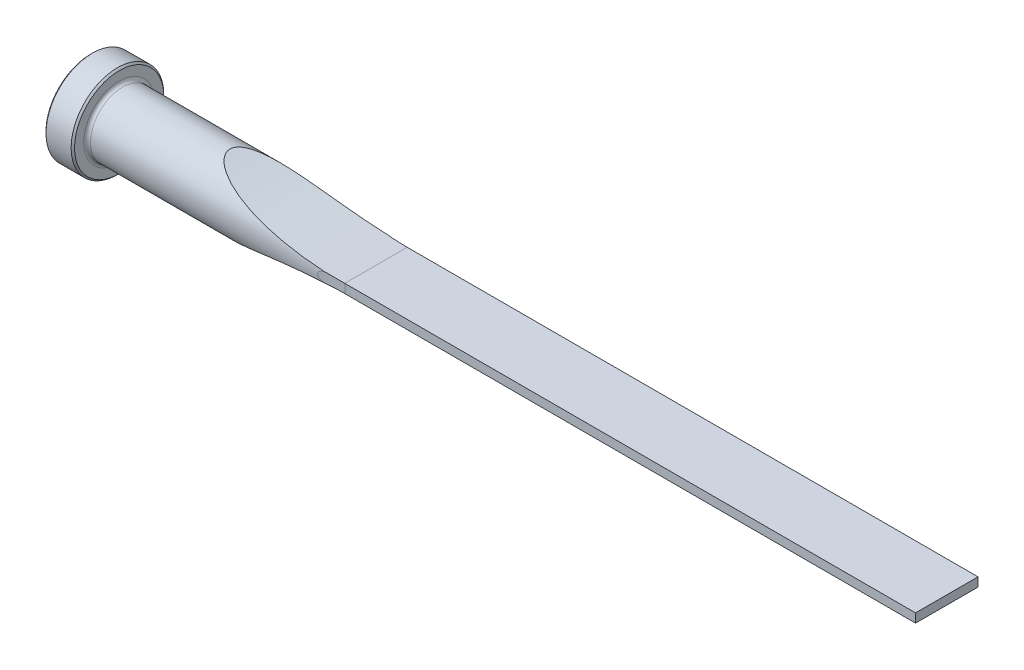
ISO-10303-21;
HEADER;
FILE_DESCRIPTION(('STEP AP214'),'2;1');
FILE_NAME('part.step','',(''),(''),'','','');
FILE_SCHEMA(('AUTOMOTIVE_DESIGN { 1 0 10303 214 1 1 1 1 }'));
ENDSEC;
DATA;
#1=APPLICATION_CONTEXT('core data for automotive mechanical design processes');
#2=APPLICATION_PROTOCOL_DEFINITION('international standard','automotive_design',2000,#1);
#3=PRODUCT_CONTEXT('',#1,'mechanical');
#4=PRODUCT('Part','Part','',(#3));
#5=PRODUCT_RELATED_PRODUCT_CATEGORY('part','',(#4));
#6=PRODUCT_DEFINITION_FORMATION('','',#4);
#7=PRODUCT_DEFINITION_CONTEXT('part definition',#1,'design');
#8=PRODUCT_DEFINITION('design','',#6,#7);
#9=PRODUCT_DEFINITION_SHAPE('','',#8);
#10=(LENGTH_UNIT() NAMED_UNIT(*) SI_UNIT(.MILLI.,.METRE.));
#11=(NAMED_UNIT(*) PLANE_ANGLE_UNIT() SI_UNIT($,.RADIAN.));
#12=(NAMED_UNIT(*) SI_UNIT($,.STERADIAN.) SOLID_ANGLE_UNIT());
#13=UNCERTAINTY_MEASURE_WITH_UNIT(LENGTH_MEASURE(1.E-05),#10,'distance_accuracy_value','');
#14=(GEOMETRIC_REPRESENTATION_CONTEXT(3) GLOBAL_UNCERTAINTY_ASSIGNED_CONTEXT((#13)) GLOBAL_UNIT_ASSIGNED_CONTEXT((#10,
#11,#12)) REPRESENTATION_CONTEXT('',''));
#15=CARTESIAN_POINT('',(0.,0.,0.));
#16=DIRECTION('',(0.,0.,1.));
#17=DIRECTION('',(1.,0.,0.));
#18=AXIS2_PLACEMENT_3D('',#15,#16,#17);
#19=CARTESIAN_POINT('',(0.,0.,0.));
#20=DIRECTION('',(-1.,0.,0.));
#21=DIRECTION('',(0.,0.,1.));
#22=AXIS2_PLACEMENT_3D('',#19,#20,#21);
#23=CYLINDRICAL_SURFACE('',#22,7.14375);
#24=CARTESIAN_POINT('',(7.112,0.,0.));
#25=DIRECTION('',(-1.,0.,0.));
#26=DIRECTION('',(0.,0.,1.));
#27=AXIS2_PLACEMENT_3D('',#24,#25,#26);
#28=CIRCLE('',#27,7.14375);
#29=CARTESIAN_POINT('',(7.112,0.,7.14375));
#30=VERTEX_POINT('',#29);
#31=EDGE_CURVE('E153',#30,#30,#28,.F.);
#32=ORIENTED_EDGE('',*,*,#31,.T.);
#33=EDGE_LOOP('',(#32));
#34=FACE_BOUND('',#33,.T.);
#35=CARTESIAN_POINT('',(63.5,1.66545622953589,6.94690000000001));
#36=CARTESIAN_POINT('',(63.2602205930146,1.66539130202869,6.9468983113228));
#37=CARTESIAN_POINT('',(63.0204291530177,1.66140650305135,6.94787008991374));
#38=CARTESIAN_POINT('',(62.5409765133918,1.64513557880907,6.95174989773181));
#39=CARTESIAN_POINT('',(62.3013155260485,1.63284358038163,6.95465929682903));
#40=CARTESIAN_POINT('',(61.8211110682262,1.59939046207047,6.96242801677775));
#41=CARTESIAN_POINT('',(61.5805715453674,1.57817397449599,6.96729950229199));
#42=CARTESIAN_POINT('',(61.100708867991,1.52578189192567,6.97895857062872));
#43=CARTESIAN_POINT('',(60.8613853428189,1.49460954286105,6.98574552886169));
#44=CARTESIAN_POINT('',(60.3341219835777,1.41275931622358,7.00282004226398));
#45=CARTESIAN_POINT('',(60.046591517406,1.35935208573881,7.01354421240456));
#46=CARTESIAN_POINT('',(59.6193276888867,1.26169102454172,7.03152533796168));
#47=CARTESIAN_POINT('',(59.4775502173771,1.22620337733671,7.03783632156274));
#48=CARTESIAN_POINT('',(59.1960773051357,1.14791266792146,7.05103266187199));
#49=CARTESIAN_POINT('',(59.0563810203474,1.10511266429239,7.05791777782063));
#50=CARTESIAN_POINT('',(58.7797072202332,1.00972668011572,7.07219584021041));
#51=CARTESIAN_POINT('',(58.6427427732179,0.957102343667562,7.07959070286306));
#52=CARTESIAN_POINT('',(58.3751712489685,0.838413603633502,7.09463865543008));
#53=CARTESIAN_POINT('',(58.2445402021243,0.772405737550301,7.10229054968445));
#54=CARTESIAN_POINT('',(58.0346934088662,0.642339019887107,7.11501322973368));
#55=CARTESIAN_POINT('',(57.952121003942,0.584056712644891,7.12014673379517));
#56=CARTESIAN_POINT('',(57.8379827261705,0.48446373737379,7.12738091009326));
#57=CARTESIAN_POINT('',(57.801394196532,0.449023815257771,7.12972544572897));
#58=CARTESIAN_POINT('',(57.7337306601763,0.373169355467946,7.13409783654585));
#59=CARTESIAN_POINT('',(57.7026400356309,0.332769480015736,7.13612658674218));
#60=CARTESIAN_POINT('',(57.6599545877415,0.263678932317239,7.13892891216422));
#61=CARTESIAN_POINT('',(57.6455334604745,0.236759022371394,7.13988012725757));
#62=CARTESIAN_POINT('',(57.6208913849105,0.181039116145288,7.14150989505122));
#63=CARTESIAN_POINT('',(57.610665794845,0.152241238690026,7.142188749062));
#64=CARTESIAN_POINT('',(57.5953440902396,0.0929451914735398,7.14320728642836));
#65=CARTESIAN_POINT('',(57.5903022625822,0.0624324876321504,7.14354337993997));
#66=CARTESIAN_POINT('',(57.5862149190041,0.00100805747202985,7.1438157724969));
#67=CARTESIAN_POINT('',(57.5871656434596,-0.0299034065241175,7.14375232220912));
#68=CARTESIAN_POINT('',(57.5944670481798,-0.0874662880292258,7.14326597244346));
#69=CARTESIAN_POINT('',(57.6001902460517,-0.114201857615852,7.14288484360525));
#70=CARTESIAN_POINT('',(57.6156498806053,-0.166474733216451,7.14185795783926));
#71=CARTESIAN_POINT('',(57.6253896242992,-0.192011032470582,7.14121198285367));
#72=CARTESIAN_POINT('',(57.6541940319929,-0.254728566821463,7.13930814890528));
#73=CARTESIAN_POINT('',(57.6754634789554,-0.29088512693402,7.13790755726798));
#74=CARTESIAN_POINT('',(57.7232657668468,-0.359496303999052,7.13478175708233));
#75=CARTESIAN_POINT('',(57.7498129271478,-0.39194046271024,7.13305566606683));
#76=CARTESIAN_POINT('',(57.8310525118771,-0.480375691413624,7.12781634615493));
#77=CARTESIAN_POINT('',(57.8901250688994,-0.53227243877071,7.12405564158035));
#78=CARTESIAN_POINT('',(58.0145571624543,-0.627749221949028,7.11627461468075));
#79=CARTESIAN_POINT('',(58.0799370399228,-0.671300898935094,7.11225346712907));
#80=CARTESIAN_POINT('',(58.2535094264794,-0.775899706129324,7.10178396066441));
#81=CARTESIAN_POINT('',(58.3644424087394,-0.83234654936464,7.09528710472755));
#82=CARTESIAN_POINT('',(58.590985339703,-0.935122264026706,7.08246694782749));
#83=CARTESIAN_POINT('',(58.7066056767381,-0.981427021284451,7.07614409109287));
#84=CARTESIAN_POINT('',(58.9416713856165,-1.06691744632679,7.06376189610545));
#85=CARTESIAN_POINT('',(59.0611424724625,-1.10603221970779,7.05770558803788));
#86=CARTESIAN_POINT('',(59.3017233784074,-1.17826382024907,7.04600484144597));
#87=CARTESIAN_POINT('',(59.4228312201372,-1.21138729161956,7.04035995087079));
#88=CARTESIAN_POINT('',(59.7104613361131,-1.28394915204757,7.02754987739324));
#89=CARTESIAN_POINT('',(59.8775128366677,-1.32131606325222,7.02057652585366));
#90=CARTESIAN_POINT('',(60.2131128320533,-1.38885630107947,7.00752462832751));
#91=CARTESIAN_POINT('',(60.3816617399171,-1.41902757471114,7.00144633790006));
#92=CARTESIAN_POINT('',(60.8894036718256,-1.50059649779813,6.98459356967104));
#93=CARTESIAN_POINT('',(61.2301123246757,-1.54291316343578,6.97522715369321));
#94=CARTESIAN_POINT('',(61.8927532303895,-1.60644233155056,6.96084942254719));
#95=CARTESIAN_POINT('',(62.2145799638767,-1.62877275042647,6.95560971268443));
#96=CARTESIAN_POINT('',(62.6971835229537,-1.65088759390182,6.9503801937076));
#97=CARTESIAN_POINT('',(62.8577023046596,-1.65636275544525,6.94907536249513));
#98=CARTESIAN_POINT('',(63.1788130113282,-1.66364180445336,6.94733518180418));
#99=CARTESIAN_POINT('',(63.3394049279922,-1.66544603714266,6.94689975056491));
#100=CARTESIAN_POINT('',(63.5,-1.66545622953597,6.9469));
#101=B_SPLINE_CURVE_WITH_KNOTS('',3,(#35,#36,#37,#38,#39,#40,#41,#42,#43,#44,#45,#46,#47,#48,
#49,#50,#51,#52,#53,#54,#55,#56,#57,#58,#59,#60,#61,#62,#63,#64,#65,#66,#67,#68,#69,#70,#71,#72,
#73,#74,#75,#76,#77,#78,#79,#80,#81,#82,#83,#84,#85,#86,#87,#88,#89,#90,#91,#92,#93,#94,#95,#96,
#97,#98,#99,#100),.UNSPECIFIED.,.F.,.F.,(4,2,2,2,2,2,2,2,2,2,2,2,2,2,2,2,2,2,2,2,2,2,2,2,2,2,2,
2,2,2,2,2,4),(0.,0.719321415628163,1.43915192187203,2.1635157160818,2.88764358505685,
3.76473487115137,4.20345743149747,4.64199693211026,5.08228579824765,5.52075206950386,
5.82287393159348,5.97551162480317,6.12770850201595,6.21909711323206,6.31038434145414,
6.40261812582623,6.49479405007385,6.57646960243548,6.65821253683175,6.78340264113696,
6.90893716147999,7.14377497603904,7.37939720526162,7.75236878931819,8.12621776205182,
8.50357546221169,8.88051208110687,9.39425854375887,9.90815140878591,10.9377202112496,
11.905257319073,12.3870700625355,12.8688374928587),.UNSPECIFIED.);
#102=CARTESIAN_POINT('',(59.0519236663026,1.10194860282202,7.05824860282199));
#103=VERTEX_POINT('',#102);
#104=CARTESIAN_POINT('',(59.0519236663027,-1.101948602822,7.058248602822));
#105=VERTEX_POINT('',#104);
#106=EDGE_CURVE('E156',#103,#105,#101,.T.);
#107=ORIENTED_EDGE('',*,*,#106,.F.);
#108=CARTESIAN_POINT('',(63.5,0.990599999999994,7.07473502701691));
#109=CARTESIAN_POINT('',(62.9103241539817,0.990599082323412,7.07470296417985));
#110=CARTESIAN_POINT('',(62.3206477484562,0.996466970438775,7.07391235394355));
#111=CARTESIAN_POINT('',(61.1415303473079,1.01993388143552,7.07058423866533));
#112=CARTESIAN_POINT('',(60.5520893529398,1.03753296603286,7.06804672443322));
#113=CARTESIAN_POINT('',(59.3732377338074,1.08447362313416,7.06099231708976));
#114=CARTESIAN_POINT('',(58.7838274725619,1.11382410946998,7.05647392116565));
#115=CARTESIAN_POINT('',(57.6057314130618,1.18425404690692,7.04499738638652));
#116=CARTESIAN_POINT('',(57.0170456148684,1.22533349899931,7.03803924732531));
#117=CARTESIAN_POINT('',(55.8244251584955,1.32049668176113,7.02081585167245));
#118=CARTESIAN_POINT('',(55.2205178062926,1.37490787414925,7.01046466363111));
#119=CARTESIAN_POINT('',(54.0140276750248,1.49606453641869,6.9856124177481));
#120=CARTESIAN_POINT('',(53.4114448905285,1.56280995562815,6.97111137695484));
#121=CARTESIAN_POINT('',(52.2082743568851,1.70855010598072,6.93683094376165));
#122=CARTESIAN_POINT('',(51.6076856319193,1.78753750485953,6.91705470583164));
#123=CARTESIAN_POINT('',(50.4084984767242,1.95773166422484,6.87082457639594));
#124=CARTESIAN_POINT('',(49.8099000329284,2.04893834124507,6.84437073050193));
#125=CARTESIAN_POINT('',(48.6143658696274,2.24360840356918,6.78305377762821));
#126=CARTESIAN_POINT('',(48.0174330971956,2.34708671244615,6.74818037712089));
#127=CARTESIAN_POINT('',(46.8264543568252,2.56609326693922,6.66797848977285));
#128=CARTESIAN_POINT('',(46.2324084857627,2.68162191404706,6.6226496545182));
#129=CARTESIAN_POINT('',(45.0466634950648,2.92479431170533,6.5189162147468));
#130=CARTESIAN_POINT('',(44.4549715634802,3.05246212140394,6.46048531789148));
#131=CARTESIAN_POINT('',(43.2760816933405,3.3194249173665,6.32746650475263));
#132=CARTESIAN_POINT('',(42.6888833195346,3.45871876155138,6.25288017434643));
#133=CARTESIAN_POINT('',(41.5264508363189,3.7469545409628,6.08449921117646));
#134=CARTESIAN_POINT('',(40.9511560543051,3.89577518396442,5.99092211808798));
#135=CARTESIAN_POINT('',(40.0936030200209,4.12674767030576,5.83196356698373));
#136=CARTESIAN_POINT('',(39.8085742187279,4.20505086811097,5.7758609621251));
#137=CARTESIAN_POINT('',(39.2406776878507,4.36410003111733,5.65665009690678));
#138=CARTESIAN_POINT('',(38.9578098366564,4.44484585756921,5.59354223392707));
#139=CARTESIAN_POINT('',(38.3956379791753,4.60832522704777,5.45963602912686));
#140=CARTESIAN_POINT('',(38.1163247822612,4.69105052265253,5.38886633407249));
#141=CARTESIAN_POINT('',(37.5607622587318,4.85854663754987,5.23835580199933));
#142=CARTESIAN_POINT('',(37.2845126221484,4.94331724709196,5.15861588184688));
#143=CARTESIAN_POINT('',(36.7359696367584,5.11454699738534,4.98889726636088));
#144=CARTESIAN_POINT('',(36.4636731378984,5.20100464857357,4.89892729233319));
#145=CARTESIAN_POINT('',(35.9237786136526,5.37526169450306,4.70707325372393));
#146=CARTESIAN_POINT('',(35.6561794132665,5.46306074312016,4.60519221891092));
#147=CARTESIAN_POINT('',(35.2665465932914,5.59291612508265,4.44486458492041));
#148=CARTESIAN_POINT('',(35.1421709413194,5.63467705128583,4.39184723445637));
#149=CARTESIAN_POINT('',(34.8949544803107,5.71828624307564,4.28241819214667));
#150=CARTESIAN_POINT('',(34.7721136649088,5.76013450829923,4.22600651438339));
#151=CARTESIAN_POINT('',(34.4060515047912,5.88572718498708,4.05117747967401));
#152=CARTESIAN_POINT('',(34.1654246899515,5.96947469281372,3.92722057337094));
#153=CARTESIAN_POINT('',(33.6949271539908,6.13542400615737,3.6625148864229));
#154=CARTESIAN_POINT('',(33.4650029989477,6.21763189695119,3.52186571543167));
#155=CARTESIAN_POINT('',(33.0183679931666,6.3793056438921,3.21978250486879));
#156=CARTESIAN_POINT('',(32.8016409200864,6.45877481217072,3.05837477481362));
#157=CARTESIAN_POINT('',(32.4371987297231,6.59389778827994,2.75217825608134));
#158=CARTESIAN_POINT('',(32.2854343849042,6.65067752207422,2.61275026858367));
#159=CARTESIAN_POINT('',(31.9968284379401,6.7594749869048,2.31680001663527));
#160=CARTESIAN_POINT('',(31.8600109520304,6.8114850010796,2.16025091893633));
#161=CARTESIAN_POINT('',(31.6062737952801,6.90856051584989,1.82635315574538));
#162=CARTESIAN_POINT('',(31.4896089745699,6.95353647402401,1.6487801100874));
#163=CARTESIAN_POINT('',(31.2876750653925,7.0317565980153,1.27427241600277));
#164=CARTESIAN_POINT('',(31.2023055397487,7.06503828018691,1.07740232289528));
#165=CARTESIAN_POINT('',(31.0925894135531,7.10791984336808,0.729148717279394));
#166=CARTESIAN_POINT('',(31.0576492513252,7.12161751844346,0.581622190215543));
#167=CARTESIAN_POINT('',(31.0114591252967,7.13973680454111,0.282339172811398));
#168=CARTESIAN_POINT('',(31.0001909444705,7.14416554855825,0.130586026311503));
#169=CARTESIAN_POINT('',(31.002466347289,7.14327190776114,-0.172861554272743));
#170=CARTESIAN_POINT('',(31.0160366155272,7.13793903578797,-0.324555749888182));
#171=CARTESIAN_POINT('',(31.0666681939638,7.11808225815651,-0.623343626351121));
#172=CARTESIAN_POINT('',(31.1037477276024,7.1035512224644,-0.770433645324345));
#173=CARTESIAN_POINT('',(31.2114848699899,7.06146282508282,-1.09682669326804));
#174=CARTESIAN_POINT('',(31.2886312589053,7.03139963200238,-1.27364110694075));
#175=CARTESIAN_POINT('',(31.4684561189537,6.96171823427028,-1.61172011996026));
#176=CARTESIAN_POINT('',(31.5711889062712,6.92207970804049,-1.77295061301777));
#177=CARTESIAN_POINT('',(31.7728575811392,6.84478315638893,-2.04898139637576));
#178=CARTESIAN_POINT('',(31.8684500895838,6.80831213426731,-2.16662167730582));
#179=CARTESIAN_POINT('',(32.0690181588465,6.73222770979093,-2.39259283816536));
#180=CARTESIAN_POINT('',(32.173999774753,6.69261228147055,-2.50091762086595));
#181=CARTESIAN_POINT('',(32.3914295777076,6.61106855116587,-2.70914308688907));
#182=CARTESIAN_POINT('',(32.5038889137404,6.56913681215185,-2.80903066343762));
#183=CARTESIAN_POINT('',(32.7346711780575,6.48364767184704,-3.00108753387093));
#184=CARTESIAN_POINT('',(32.8529964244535,6.44008962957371,-3.09325373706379));
#185=CARTESIAN_POINT('',(33.0956983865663,6.35135578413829,-3.27161717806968));
#186=CARTESIAN_POINT('',(33.2201283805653,6.30616726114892,-3.35773518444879));
#187=CARTESIAN_POINT('',(33.472919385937,6.21502104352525,-3.52358007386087));
#188=CARTESIAN_POINT('',(33.6012812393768,6.16906318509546,-3.60330557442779));
#189=CARTESIAN_POINT('',(33.9913919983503,6.03043005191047,-3.83397813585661));
#190=CARTESIAN_POINT('',(34.2580036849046,5.93705473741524,-3.97630509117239));
#191=CARTESIAN_POINT('',(34.8008901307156,5.74992104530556,-4.24240850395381));
#192=CARTESIAN_POINT('',(35.0771862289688,5.65616228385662,-4.3661403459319));
#193=CARTESIAN_POINT('',(35.4966178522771,5.51618242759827,-4.53986703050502));
#194=CARTESIAN_POINT('',(35.6372314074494,5.4696413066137,-4.59578755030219));
#195=CARTESIAN_POINT('',(35.9199483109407,5.37685628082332,-4.704005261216));
#196=CARTESIAN_POINT('',(36.0620516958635,5.33061238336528,-4.75630236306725));
#197=CARTESIAN_POINT('',(36.4328034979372,5.21100242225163,-4.88779912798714));
#198=CARTESIAN_POINT('',(36.6624640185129,5.13792899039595,-4.9644168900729));
#199=CARTESIAN_POINT('',(37.1245377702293,4.99299302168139,-5.11015880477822));
#200=CARTESIAN_POINT('',(37.3569513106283,4.92113062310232,-5.17928210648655));
#201=CARTESIAN_POINT('',(38.0578110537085,4.70760025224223,-5.37674662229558));
#202=CARTESIAN_POINT('',(38.5297211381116,4.56803925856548,-5.49512883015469));
#203=CARTESIAN_POINT('',(39.4810856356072,4.29534730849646,-5.71080863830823));
#204=CARTESIAN_POINT('',(39.9605528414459,4.16222926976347,-5.80806514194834));
#205=CARTESIAN_POINT('',(40.9245387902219,3.90334760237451,-5.9851161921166));
#206=CARTESIAN_POINT('',(41.4090565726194,3.77758260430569,-6.06491399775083));
#207=CARTESIAN_POINT('',(42.3854784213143,3.53295958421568,-6.21061571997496));
#208=CARTESIAN_POINT('',(42.8774103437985,3.41415471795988,-6.27642082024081));
#209=CARTESIAN_POINT('',(43.8646304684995,3.184665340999,-6.39592032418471));
#210=CARTESIAN_POINT('',(44.3599188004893,3.07398114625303,-6.44961425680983));
#211=CARTESIAN_POINT('',(45.3527432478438,2.86103848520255,-6.54685442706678));
#212=CARTESIAN_POINT('',(45.8502765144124,2.75877143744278,-6.59041108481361));
#213=CARTESIAN_POINT('',(46.8476689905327,2.56266512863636,-6.66911262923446));
#214=CARTESIAN_POINT('',(47.3475282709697,2.46882612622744,-6.70425725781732));
#215=CARTESIAN_POINT('',(48.499556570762,2.26278321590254,-6.77703924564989));
#216=CARTESIAN_POINT('',(49.15240566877,2.15352190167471,-6.81225819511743));
#217=CARTESIAN_POINT('',(50.4608099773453,1.94955184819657,-6.87340737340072));
#218=CARTESIAN_POINT('',(51.1163652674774,1.85484353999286,-6.89933732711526));
#219=CARTESIAN_POINT('',(52.4299773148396,1.68003464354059,-6.94397486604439));
#220=CARTESIAN_POINT('',(53.088035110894,1.59994100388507,-6.96267902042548));
#221=CARTESIAN_POINT('',(54.4059097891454,1.45448169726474,-6.99451117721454));
#222=CARTESIAN_POINT('',(55.065726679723,1.38911610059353,-7.00763915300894));
#223=CARTESIAN_POINT('',(56.3725663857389,1.27440132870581,-7.02939518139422));
#224=CARTESIAN_POINT('',(57.0195602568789,1.22473885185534,-7.03811366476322));
#225=CARTESIAN_POINT('',(58.3145139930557,1.1395899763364,-7.05240106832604));
#226=CARTESIAN_POINT('',(58.9624738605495,1.10410361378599,-7.05796998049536));
#227=CARTESIAN_POINT('',(60.2585443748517,1.04734819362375,-7.06661537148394));
#228=CARTESIAN_POINT('',(60.9066545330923,1.02606835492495,-7.0696937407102));
#229=CARTESIAN_POINT('',(61.8790426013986,1.00478777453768,-7.07273700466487));
#230=CARTESIAN_POINT('',(62.2032098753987,0.999467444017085,-7.07348904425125));
#231=CARTESIAN_POINT('',(62.8515838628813,0.992373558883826,-7.07448698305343));
#232=CARTESIAN_POINT('',(63.1757905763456,0.990600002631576,-7.07473288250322));
#233=CARTESIAN_POINT('',(63.5,0.990599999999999,-7.07473502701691));
#234=B_SPLINE_CURVE_WITH_KNOTS('',3,(#108,#109,#110,#111,#112,#113,#114,#115,#116,#117,#118,
#119,#120,#121,#122,#123,#124,#125,#126,#127,#128,#129,#130,#131,#132,#133,#134,#135,#136,#137,
#138,#139,#140,#141,#142,#143,#144,#145,#146,#147,#148,#149,#150,#151,#152,#153,#154,#155,#156,
#157,#158,#159,#160,#161,#162,#163,#164,#165,#166,#167,#168,#169,#170,#171,#172,#173,#174,#175,
#176,#177,#178,#179,#180,#181,#182,#183,#184,#185,#186,#187,#188,#189,#190,#191,#192,#193,#194,
#195,#196,#197,#198,#199,#200,#201,#202,#203,#204,#205,#206,#207,#208,#209,#210,#211,#212,#213,
#214,#215,#216,#217,#218,#219,#220,#221,#222,#223,#224,#225,#226,#227,#228,#229,#230,#231,#232,
#233),.UNSPECIFIED.,.F.,.F.,(4,2,2,2,2,2,2,2,2,2,2,2,2,2,2,2,2,2,2,2,2,2,2,2,2,2,2,2,2,2,2,2,2,
2,2,2,2,2,2,2,2,2,2,2,2,2,2,2,2,2,2,2,2,2,2,2,2,2,2,2,2,2,4),(0.,1.76899870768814,
3.53800672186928,5.3083591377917,7.07871170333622,8.89789901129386,10.7170788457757,
12.5351732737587,14.3532552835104,16.1735713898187,17.9939481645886,19.8180111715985,
21.6418952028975,23.4459595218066,24.348477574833,25.2509444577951,26.1501465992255,
27.0492569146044,27.9476063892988,28.8457278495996,29.2702041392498,29.6946786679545,
30.5440820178,31.3886498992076,32.2321577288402,32.8725009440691,33.5138625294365,
34.1628200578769,34.8096762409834,35.2644090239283,35.7187917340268,36.1736628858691,
36.6288870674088,37.2113595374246,37.7950792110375,38.2621575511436,38.7295393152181,
39.197634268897,39.6659157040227,40.1394894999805,40.6131654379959,41.5611402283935,
42.5113543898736,42.9862741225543,43.4612055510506,44.2197187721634,44.9783180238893,
46.4960308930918,48.0166702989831,49.5370255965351,51.0677850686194,52.5986040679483,
54.1278425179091,55.6571278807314,57.6454629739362,59.6338569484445,61.6231938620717,
63.6125402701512,65.559241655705,67.5059480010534,69.4511753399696,70.4237936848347,
71.3964115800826),.UNSPECIFIED.);
#235=CARTESIAN_POINT('',(59.0519236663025,1.10194860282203,-7.05824860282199));
#236=VERTEX_POINT('',#235);
#237=EDGE_CURVE('E106',#103,#236,#234,.T.);
#238=ORIENTED_EDGE('',*,*,#237,.T.);
#239=CARTESIAN_POINT('',(63.5,1.66545622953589,-6.94690000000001));
#240=CARTESIAN_POINT('',(63.2602205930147,1.66539130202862,-6.94689831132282));
#241=CARTESIAN_POINT('',(63.0204291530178,1.66140650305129,-6.94787008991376));
#242=CARTESIAN_POINT('',(62.540976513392,1.64513557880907,-6.95174989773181));
#243=CARTESIAN_POINT('',(62.3013155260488,1.63284358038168,-6.95465929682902));
#244=CARTESIAN_POINT('',(61.8211110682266,1.59939046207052,-6.96242801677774));
#245=CARTESIAN_POINT('',(61.5805715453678,1.57817397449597,-6.96729950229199));
#246=CARTESIAN_POINT('',(61.1007088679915,1.52578189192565,-6.97895857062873));
#247=CARTESIAN_POINT('',(60.8613853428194,1.49460954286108,-6.98574552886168));
#248=CARTESIAN_POINT('',(60.3341219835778,1.4127593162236,-7.00282004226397));
#249=CARTESIAN_POINT('',(60.0465915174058,1.35935208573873,-7.01354421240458));
#250=CARTESIAN_POINT('',(59.6193276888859,1.2616910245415,-7.03152533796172));
#251=CARTESIAN_POINT('',(59.4775502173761,1.22620337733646,-7.03783632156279));
#252=CARTESIAN_POINT('',(59.1960773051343,1.1479126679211,-7.05103266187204));
#253=CARTESIAN_POINT('',(59.0563810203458,1.10511266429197,-7.0579177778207));
#254=CARTESIAN_POINT('',(58.7797072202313,1.00972668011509,-7.0721958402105));
#255=CARTESIAN_POINT('',(58.6427427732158,0.957102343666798,-7.07959070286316));
#256=CARTESIAN_POINT('',(58.3751712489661,0.83841360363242,-7.09463865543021));
#257=CARTESIAN_POINT('',(58.2445402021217,0.772405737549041,-7.10229054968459));
#258=CARTESIAN_POINT('',(58.0346934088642,0.642339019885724,-7.1150132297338));
#259=CARTESIAN_POINT('',(57.9521210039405,0.584056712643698,-7.12014673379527));
#260=CARTESIAN_POINT('',(57.8379827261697,0.484463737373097,-7.12738091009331));
#261=CARTESIAN_POINT('',(57.8013941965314,0.449023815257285,-7.129725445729));
#262=CARTESIAN_POINT('',(57.7337306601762,0.373169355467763,-7.13409783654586));
#263=CARTESIAN_POINT('',(57.7026400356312,0.332769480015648,-7.13612658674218));
#264=CARTESIAN_POINT('',(57.6599545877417,0.263678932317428,-7.13892891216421));
#265=CARTESIAN_POINT('',(57.6455334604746,0.236759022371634,-7.13988012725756));
#266=CARTESIAN_POINT('',(57.6208913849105,0.181039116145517,-7.14150989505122));
#267=CARTESIAN_POINT('',(57.610665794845,0.152241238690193,-7.142188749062));
#268=CARTESIAN_POINT('',(57.5953440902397,0.0929451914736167,-7.14320728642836));
#269=CARTESIAN_POINT('',(57.5903022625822,0.0624324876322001,-7.14354337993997));
#270=CARTESIAN_POINT('',(57.5862149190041,0.00100805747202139,-7.14381577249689));
#271=CARTESIAN_POINT('',(57.5871656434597,-0.029903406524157,-7.14375232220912));
#272=CARTESIAN_POINT('',(57.5944670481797,-0.0874662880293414,-7.14326597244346));
#273=CARTESIAN_POINT('',(57.6001902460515,-0.114201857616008,-7.14288484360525));
#274=CARTESIAN_POINT('',(57.6156498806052,-0.166474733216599,-7.14185795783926));
#275=CARTESIAN_POINT('',(57.6253896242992,-0.192011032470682,-7.14121198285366));
#276=CARTESIAN_POINT('',(57.654194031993,-0.254728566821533,-7.13930814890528));
#277=CARTESIAN_POINT('',(57.6754634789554,-0.290885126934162,-7.13790755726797));
#278=CARTESIAN_POINT('',(57.7232657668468,-0.359496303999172,-7.13478175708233));
#279=CARTESIAN_POINT('',(57.7498129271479,-0.391940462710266,-7.13305566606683));
#280=CARTESIAN_POINT('',(57.8310525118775,-0.480375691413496,-7.12781634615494));
#281=CARTESIAN_POINT('',(57.8901250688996,-0.532272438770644,-7.12405564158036));
#282=CARTESIAN_POINT('',(58.0145571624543,-0.627749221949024,-7.11627461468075));
#283=CARTESIAN_POINT('',(58.0799370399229,-0.67130089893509,-7.11225346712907));
#284=CARTESIAN_POINT('',(58.2535094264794,-0.775899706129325,-7.10178396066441));
#285=CARTESIAN_POINT('',(58.3644424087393,-0.832346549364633,-7.09528710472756));
#286=CARTESIAN_POINT('',(58.5909853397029,-0.93512226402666,-7.0824669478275));
#287=CARTESIAN_POINT('',(58.7066056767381,-0.981427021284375,-7.07614409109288));
#288=CARTESIAN_POINT('',(58.9416713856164,-1.06691744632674,-7.06376189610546));
#289=CARTESIAN_POINT('',(59.0611424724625,-1.10603221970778,-7.05770558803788));
#290=CARTESIAN_POINT('',(59.3017233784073,-1.17826382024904,-7.04600484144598));
#291=CARTESIAN_POINT('',(59.4228312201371,-1.21138729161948,-7.04035995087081));
#292=CARTESIAN_POINT('',(59.7104613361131,-1.28394915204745,-7.02754987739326));
#293=CARTESIAN_POINT('',(59.8775128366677,-1.32131606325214,-7.02057652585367));
#294=CARTESIAN_POINT('',(60.2131128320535,-1.38885630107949,-7.00752462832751));
#295=CARTESIAN_POINT('',(60.3816617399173,-1.41902757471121,-7.00144633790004));
#296=CARTESIAN_POINT('',(60.889403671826,-1.50059649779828,-6.98459356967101));
#297=CARTESIAN_POINT('',(61.2301123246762,-1.54291316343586,-6.9752271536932));
#298=CARTESIAN_POINT('',(61.89275323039,-1.60644233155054,-6.9608494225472));
#299=CARTESIAN_POINT('',(62.2145799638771,-1.62877275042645,-6.95560971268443));
#300=CARTESIAN_POINT('',(62.6971835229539,-1.65088759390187,-6.95038019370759));
#301=CARTESIAN_POINT('',(62.8577023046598,-1.65636275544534,-6.94907536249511));
#302=CARTESIAN_POINT('',(63.1788130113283,-1.66364180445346,-6.94733518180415));
#303=CARTESIAN_POINT('',(63.3394049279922,-1.66544603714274,-6.94689975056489));
#304=CARTESIAN_POINT('',(63.5,-1.66545622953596,-6.9469));
#305=B_SPLINE_CURVE_WITH_KNOTS('',3,(#239,#240,#241,#242,#243,#244,#245,#246,#247,#248,#249,
#250,#251,#252,#253,#254,#255,#256,#257,#258,#259,#260,#261,#262,#263,#264,#265,#266,#267,#268,
#269,#270,#271,#272,#273,#274,#275,#276,#277,#278,#279,#280,#281,#282,#283,#284,#285,#286,#287,
#288,#289,#290,#291,#292,#293,#294,#295,#296,#297,#298,#299,#300,#301,#302,#303,#304),
.UNSPECIFIED.,.F.,.F.,(4,2,2,2,2,2,2,2,2,2,2,2,2,2,2,2,2,2,2,2,2,2,2,2,2,2,2,2,2,2,2,2,4),(0.,
0.719321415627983,1.43915192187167,2.1635157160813,2.88764358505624,3.76473487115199,
4.20345743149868,4.64199693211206,5.08228579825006,5.52075206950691,5.82287393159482,
5.97551162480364,6.1277085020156,6.21909711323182,6.31038434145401,6.40261812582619,
6.49479405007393,6.57646960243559,6.65821253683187,6.78340264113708,6.90893716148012,
7.1437749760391,7.37939720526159,7.75236878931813,8.12621776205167,8.50357546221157,
8.88051208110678,9.39425854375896,9.90815140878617,10.9377202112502,11.9052573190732,
12.3870700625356,12.8688374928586),.UNSPECIFIED.);
#306=CARTESIAN_POINT('',(59.0519236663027,-1.101948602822,-7.058248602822));
#307=VERTEX_POINT('',#306);
#308=EDGE_CURVE('E175',#236,#307,#305,.T.);
#309=ORIENTED_EDGE('',*,*,#308,.T.);
#310=CARTESIAN_POINT('',(63.5,-0.990599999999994,7.07473502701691));
#311=CARTESIAN_POINT('',(62.9103241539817,-0.990599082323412,7.07470296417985));
#312=CARTESIAN_POINT('',(62.3206477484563,-0.996466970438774,7.07391235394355));
#313=CARTESIAN_POINT('',(61.1415303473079,-1.01993388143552,7.07058423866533));
#314=CARTESIAN_POINT('',(60.5520893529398,-1.03753296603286,7.06804672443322));
#315=CARTESIAN_POINT('',(59.3732377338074,-1.08447362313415,7.06099231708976));
#316=CARTESIAN_POINT('',(58.783827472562,-1.11382410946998,7.05647392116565));
#317=CARTESIAN_POINT('',(57.6057314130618,-1.18425404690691,7.04499738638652));
#318=CARTESIAN_POINT('',(57.0170456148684,-1.22533349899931,7.03803924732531));
#319=CARTESIAN_POINT('',(55.8244251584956,-1.32049668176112,7.02081585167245));
#320=CARTESIAN_POINT('',(55.2205178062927,-1.37490787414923,7.01046466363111));
#321=CARTESIAN_POINT('',(54.0140276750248,-1.49606453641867,6.9856124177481));
#322=CARTESIAN_POINT('',(53.4114448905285,-1.56280995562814,6.97111137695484));
#323=CARTESIAN_POINT('',(52.2082743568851,-1.70855010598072,6.93683094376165));
#324=CARTESIAN_POINT('',(51.6076856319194,-1.78753750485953,6.91705470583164));
#325=CARTESIAN_POINT('',(50.4084984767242,-1.95773166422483,6.87082457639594));
#326=CARTESIAN_POINT('',(49.8099000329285,-2.04893834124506,6.84437073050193));
#327=CARTESIAN_POINT('',(48.6143658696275,-2.24360840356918,6.78305377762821));
#328=CARTESIAN_POINT('',(48.0174330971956,-2.34708671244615,6.74818037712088));
#329=CARTESIAN_POINT('',(46.8264543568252,-2.56609326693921,6.66797848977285));
#330=CARTESIAN_POINT('',(46.2324084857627,-2.68162191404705,6.62264965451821));
#331=CARTESIAN_POINT('',(45.0466634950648,-2.9247943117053,6.51891621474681));
#332=CARTESIAN_POINT('',(44.4549715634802,-3.05246212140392,6.46048531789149));
#333=CARTESIAN_POINT('',(43.2760816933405,-3.31942491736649,6.32746650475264));
#334=CARTESIAN_POINT('',(42.6888833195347,-3.45871876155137,6.25288017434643));
#335=CARTESIAN_POINT('',(41.5264508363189,-3.74695454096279,6.08449921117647));
#336=CARTESIAN_POINT('',(40.9511560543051,-3.8957751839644,5.990922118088));
#337=CARTESIAN_POINT('',(40.0936030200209,-4.12674767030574,5.83196356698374));
#338=CARTESIAN_POINT('',(39.808574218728,-4.20505086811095,5.77586096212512));
#339=CARTESIAN_POINT('',(39.2406776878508,-4.36410003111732,5.6566500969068));
#340=CARTESIAN_POINT('',(38.9578098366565,-4.4448458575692,5.59354223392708));
#341=CARTESIAN_POINT('',(38.3956379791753,-4.60832522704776,5.45963602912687));
#342=CARTESIAN_POINT('',(38.1163247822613,-4.69105052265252,5.3888663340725));
#343=CARTESIAN_POINT('',(37.5607622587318,-4.85854663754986,5.23835580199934));
#344=CARTESIAN_POINT('',(37.2845126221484,-4.94331724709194,5.15861588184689));
#345=CARTESIAN_POINT('',(36.7359696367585,-5.11454699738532,4.9888972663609));
#346=CARTESIAN_POINT('',(36.4636731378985,-5.20100464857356,4.89892729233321));
#347=CARTESIAN_POINT('',(35.9237786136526,-5.37526169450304,4.70707325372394));
#348=CARTESIAN_POINT('',(35.6561794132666,-5.46306074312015,4.60519221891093));
#349=CARTESIAN_POINT('',(35.2665465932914,-5.59291612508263,4.44486458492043));
#350=CARTESIAN_POINT('',(35.1421709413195,-5.63467705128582,4.39184723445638));
#351=CARTESIAN_POINT('',(34.8949544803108,-5.71828624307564,4.28241819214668));
#352=CARTESIAN_POINT('',(34.7721136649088,-5.76013450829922,4.22600651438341));
#353=CARTESIAN_POINT('',(34.4060515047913,-5.88572718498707,4.05117747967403));
#354=CARTESIAN_POINT('',(34.1654246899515,-5.96947469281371,3.92722057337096));
#355=CARTESIAN_POINT('',(33.6949271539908,-6.13542400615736,3.66251488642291));
#356=CARTESIAN_POINT('',(33.4650029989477,-6.21763189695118,3.52186571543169));
#357=CARTESIAN_POINT('',(33.0183679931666,-6.3793056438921,3.21978250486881));
#358=CARTESIAN_POINT('',(32.8016409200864,-6.45877481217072,3.05837477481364));
#359=CARTESIAN_POINT('',(32.4371987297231,-6.59389778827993,2.75217825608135));
#360=CARTESIAN_POINT('',(32.2854343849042,-6.65067752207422,2.61275026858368));
#361=CARTESIAN_POINT('',(31.9968284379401,-6.7594749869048,2.31680001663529));
#362=CARTESIAN_POINT('',(31.8600109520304,-6.8114850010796,2.16025091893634));
#363=CARTESIAN_POINT('',(31.6062737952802,-6.90856051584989,1.8263531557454));
#364=CARTESIAN_POINT('',(31.4896089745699,-6.95353647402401,1.64878011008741));
#365=CARTESIAN_POINT('',(31.2876750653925,-7.0317565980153,1.27427241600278));
#366=CARTESIAN_POINT('',(31.2023055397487,-7.0650382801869,1.07740232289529));
#367=CARTESIAN_POINT('',(31.0925894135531,-7.10791984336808,0.729148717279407));
#368=CARTESIAN_POINT('',(31.0576492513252,-7.12161751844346,0.581622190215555));
#369=CARTESIAN_POINT('',(31.0114591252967,-7.13973680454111,0.28233917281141));
#370=CARTESIAN_POINT('',(31.0001909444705,-7.14416554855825,0.130586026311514));
#371=CARTESIAN_POINT('',(31.002466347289,-7.14327190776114,-0.172861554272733));
#372=CARTESIAN_POINT('',(31.0160366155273,-7.13793903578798,-0.324555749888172));
#373=CARTESIAN_POINT('',(31.0666681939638,-7.11808225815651,-0.623343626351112));
#374=CARTESIAN_POINT('',(31.1037477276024,-7.1035512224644,-0.770433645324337));
#375=CARTESIAN_POINT('',(31.2114848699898,-7.06146282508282,-1.09682669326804));
#376=CARTESIAN_POINT('',(31.2886312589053,-7.03139963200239,-1.27364110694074));
#377=CARTESIAN_POINT('',(31.4684561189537,-6.96171823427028,-1.61172011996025));
#378=CARTESIAN_POINT('',(31.5711889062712,-6.92207970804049,-1.77295061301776));
#379=CARTESIAN_POINT('',(31.7728575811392,-6.84478315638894,-2.04898139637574));
#380=CARTESIAN_POINT('',(31.8684500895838,-6.80831213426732,-2.16662167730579));
#381=CARTESIAN_POINT('',(32.0690181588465,-6.73222770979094,-2.39259283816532));
#382=CARTESIAN_POINT('',(32.173999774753,-6.69261228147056,-2.50091762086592));
#383=CARTESIAN_POINT('',(32.3914295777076,-6.61106855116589,-2.70914308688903));
#384=CARTESIAN_POINT('',(32.5038889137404,-6.56913681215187,-2.80903066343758));
#385=CARTESIAN_POINT('',(32.7346711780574,-6.48364767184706,-3.0010875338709));
#386=CARTESIAN_POINT('',(32.8529964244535,-6.44008962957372,-3.09325373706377));
#387=CARTESIAN_POINT('',(33.0956983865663,-6.3513557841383,-3.27161717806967));
#388=CARTESIAN_POINT('',(33.2201283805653,-6.30616726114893,-3.35773518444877));
#389=CARTESIAN_POINT('',(33.4729193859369,-6.21502104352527,-3.52358007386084));
#390=CARTESIAN_POINT('',(33.6012812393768,-6.16906318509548,-3.60330557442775));
#391=CARTESIAN_POINT('',(33.9913919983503,-6.03043005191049,-3.83397813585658));
#392=CARTESIAN_POINT('',(34.2580036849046,-5.93705473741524,-3.97630509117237));
#393=CARTESIAN_POINT('',(34.8008901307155,-5.74992104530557,-4.24240850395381));
#394=CARTESIAN_POINT('',(35.0771862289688,-5.65616228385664,-4.36614034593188));
#395=CARTESIAN_POINT('',(35.496617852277,-5.51618242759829,-4.53986703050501));
#396=CARTESIAN_POINT('',(35.6372314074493,-5.4696413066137,-4.59578755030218));
#397=CARTESIAN_POINT('',(35.9199483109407,-5.37685628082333,-4.70400526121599));
#398=CARTESIAN_POINT('',(36.0620516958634,-5.3306123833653,-4.75630236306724));
#399=CARTESIAN_POINT('',(36.4328034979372,-5.21100242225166,-4.88779912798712));
#400=CARTESIAN_POINT('',(36.6624640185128,-5.13792899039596,-4.9644168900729));
#401=CARTESIAN_POINT('',(37.1245377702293,-4.99299302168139,-5.11015880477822));
#402=CARTESIAN_POINT('',(37.3569513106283,-4.92113062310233,-5.17928210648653));
#403=CARTESIAN_POINT('',(38.0578110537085,-4.70760025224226,-5.37674662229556));
#404=CARTESIAN_POINT('',(38.5297211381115,-4.56803925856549,-5.49512883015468));
#405=CARTESIAN_POINT('',(39.4810856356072,-4.29534730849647,-5.71080863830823));
#406=CARTESIAN_POINT('',(39.9605528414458,-4.16222926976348,-5.80806514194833));
#407=CARTESIAN_POINT('',(40.9245387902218,-3.90334760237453,-5.98511619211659));
#408=CARTESIAN_POINT('',(41.4090565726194,-3.77758260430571,-6.06491399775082));
#409=CARTESIAN_POINT('',(42.3854784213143,-3.53295958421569,-6.21061571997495));
#410=CARTESIAN_POINT('',(42.8774103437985,-3.41415471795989,-6.2764208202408));
#411=CARTESIAN_POINT('',(43.8646304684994,-3.18466534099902,-6.3959203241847));
#412=CARTESIAN_POINT('',(44.3599188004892,-3.07398114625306,-6.44961425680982));
#413=CARTESIAN_POINT('',(45.3527432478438,-2.86103848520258,-6.54685442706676));
#414=CARTESIAN_POINT('',(45.8502765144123,-2.75877143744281,-6.5904110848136));
#415=CARTESIAN_POINT('',(46.8476689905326,-2.56266512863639,-6.66911262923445));
#416=CARTESIAN_POINT('',(47.3475282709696,-2.46882612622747,-6.70425725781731));
#417=CARTESIAN_POINT('',(48.499556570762,-2.26278321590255,-6.77703924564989));
#418=CARTESIAN_POINT('',(49.1524056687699,-2.15352190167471,-6.81225819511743));
#419=CARTESIAN_POINT('',(50.4608099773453,-1.94955184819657,-6.87340737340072));
#420=CARTESIAN_POINT('',(51.1163652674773,-1.85484353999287,-6.89933732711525));
#421=CARTESIAN_POINT('',(52.4299773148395,-1.6800346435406,-6.94397486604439));
#422=CARTESIAN_POINT('',(53.0880351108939,-1.59994100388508,-6.96267902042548));
#423=CARTESIAN_POINT('',(54.4059097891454,-1.45448169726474,-6.99451117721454));
#424=CARTESIAN_POINT('',(55.065726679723,-1.38911610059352,-7.00763915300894));
#425=CARTESIAN_POINT('',(56.3725663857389,-1.27440132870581,-7.02939518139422));
#426=CARTESIAN_POINT('',(57.0195602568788,-1.22473885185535,-7.03811366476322));
#427=CARTESIAN_POINT('',(58.3145139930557,-1.13958997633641,-7.05240106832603));
#428=CARTESIAN_POINT('',(58.9624738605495,-1.10410361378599,-7.05796998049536));
#429=CARTESIAN_POINT('',(60.2585443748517,-1.04734819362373,-7.06661537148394));
#430=CARTESIAN_POINT('',(60.9066545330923,-1.02606835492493,-7.0696937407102));
#431=CARTESIAN_POINT('',(61.8790426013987,-1.00478777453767,-7.07273700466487));
#432=CARTESIAN_POINT('',(62.2032098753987,-0.999467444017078,-7.07348904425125));
#433=CARTESIAN_POINT('',(62.8515838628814,-0.992373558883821,-7.07448698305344));
#434=CARTESIAN_POINT('',(63.1757905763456,-0.990600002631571,-7.07473288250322));
#435=CARTESIAN_POINT('',(63.5,-0.990599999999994,-7.07473502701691));
#436=B_SPLINE_CURVE_WITH_KNOTS('',3,(#310,#311,#312,#313,#314,#315,#316,#317,#318,#319,#320,
#321,#322,#323,#324,#325,#326,#327,#328,#329,#330,#331,#332,#333,#334,#335,#336,#337,#338,#339,
#340,#341,#342,#343,#344,#345,#346,#347,#348,#349,#350,#351,#352,#353,#354,#355,#356,#357,#358,
#359,#360,#361,#362,#363,#364,#365,#366,#367,#368,#369,#370,#371,#372,#373,#374,#375,#376,#377,
#378,#379,#380,#381,#382,#383,#384,#385,#386,#387,#388,#389,#390,#391,#392,#393,#394,#395,#396,
#397,#398,#399,#400,#401,#402,#403,#404,#405,#406,#407,#408,#409,#410,#411,#412,#413,#414,#415,
#416,#417,#418,#419,#420,#421,#422,#423,#424,#425,#426,#427,#428,#429,#430,#431,#432,#433,#434,
#435),.UNSPECIFIED.,.F.,.F.,(4,2,2,2,2,2,2,2,2,2,2,2,2,2,2,2,2,2,2,2,2,2,2,2,2,2,2,2,2,2,2,2,2,
2,2,2,2,2,2,2,2,2,2,2,2,2,2,2,2,2,2,2,2,2,2,2,2,2,2,2,2,2,4),(0.,1.76899870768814,
3.53800672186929,5.30835913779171,7.07871170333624,8.89789901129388,10.7170788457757,
12.5351732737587,14.3532552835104,16.1735713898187,17.9939481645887,19.8180111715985,
21.6418952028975,23.4459595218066,24.348477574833,25.2509444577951,26.1501465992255,
27.0492569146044,27.9476063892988,28.8457278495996,29.2702041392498,29.6946786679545,
30.5440820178,31.3886498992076,32.2321577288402,32.8725009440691,33.5138625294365,
34.162820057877,34.8096762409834,35.2644090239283,35.7187917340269,36.1736628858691,
36.6288870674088,37.2113595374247,37.7950792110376,38.2621575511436,38.7295393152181,
39.197634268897,39.6659157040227,40.1394894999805,40.6131654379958,41.5611402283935,
42.5113543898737,42.9862741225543,43.4612055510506,44.2197187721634,44.9783180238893,
46.4960308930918,48.0166702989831,49.5370255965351,51.0677850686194,52.5986040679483,
54.127842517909,55.6571278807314,57.6454629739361,59.6338569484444,61.6231938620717,
63.6125402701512,65.559241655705,67.5059480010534,69.4511753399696,70.4237936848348,
71.3964115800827),.UNSPECIFIED.);
#437=EDGE_CURVE('E105',#105,#307,#436,.T.);
#438=ORIENTED_EDGE('',*,*,#437,.F.);
#439=EDGE_LOOP('',(#107,#238,#309,#438));
#440=FACE_BOUND('',#439,.T.);
#441=ADVANCED_FACE('F33',(#34,#440),#23,.T.);
#442=CARTESIAN_POINT('',(190.5,7.14375,0.));
#443=DIRECTION('',(-1.,0.,0.));
#444=DIRECTION('',(0.,0.,1.));
#445=AXIS2_PLACEMENT_3D('',#442,#443,#444);
#446=PLANE('',#445);
#447=DIRECTION('',(0.,1.,0.));
#448=VECTOR('',#447,1.);
#449=CARTESIAN_POINT('',(190.5,-10.3124,6.9469));
#450=LINE('',#449,#448);
#451=CARTESIAN_POINT('',(190.5,-0.990600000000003,6.9469));
#452=VERTEX_POINT('',#451);
#453=CARTESIAN_POINT('',(190.5,0.990600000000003,6.9469));
#454=VERTEX_POINT('',#453);
#455=EDGE_CURVE('E87',#452,#454,#450,.T.);
#456=ORIENTED_EDGE('',*,*,#455,.F.);
#457=DIRECTION('',(0.,0.,1.));
#458=VECTOR('',#457,1.);
#459=CARTESIAN_POINT('',(190.5,-0.990600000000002,0.));
#460=LINE('',#459,#458);
#461=CARTESIAN_POINT('',(190.5,-0.990600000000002,-6.9469));
#462=VERTEX_POINT('',#461);
#463=EDGE_CURVE('E100',#462,#452,#460,.T.);
#464=ORIENTED_EDGE('',*,*,#463,.F.);
#465=DIRECTION('',(0.,1.,0.));
#466=VECTOR('',#465,1.);
#467=CARTESIAN_POINT('',(190.5,-10.3124,-6.9469));
#468=LINE('',#467,#466);
#469=CARTESIAN_POINT('',(190.5,0.990599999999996,-6.9469));
#470=VERTEX_POINT('',#469);
#471=EDGE_CURVE('E56',#462,#470,#468,.T.);
#472=ORIENTED_EDGE('',*,*,#471,.T.);
#473=DIRECTION('',(0.,0.,1.));
#474=VECTOR('',#473,1.);
#475=CARTESIAN_POINT('',(190.5,0.990600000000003,0.));
#476=LINE('',#475,#474);
#477=EDGE_CURVE('E102',#470,#454,#476,.T.);
#478=ORIENTED_EDGE('',*,*,#477,.T.);
#479=EDGE_LOOP('',(#456,#464,#472,#478));
#480=FACE_BOUND('',#479,.T.);
#481=ADVANCED_FACE('F99',(#480),#446,.F.);
#482=CARTESIAN_POINT('',(63.5,89.8906,-10.3124));
#483=DIRECTION('',(0.,0.,1.));
#484=DIRECTION('',(1.,0.,0.));
#485=AXIS2_PLACEMENT_3D('',#482,#483,#484);
#486=CYLINDRICAL_SURFACE('',#485,88.9);
#487=CARTESIAN_POINT('',(63.5,89.8906,95.8469));
#488=DIRECTION('',(0.,-0.707106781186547,0.707106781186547));
#489=DIRECTION('',(0.,0.707106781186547,0.707106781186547));
#490=AXIS2_PLACEMENT_3D('',#487,#488,#489);
#491=ELLIPSE('',#490,125.723585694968,88.9);
#492=CARTESIAN_POINT('',(63.5,0.990599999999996,6.94689999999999));
#493=VERTEX_POINT('',#492);
#494=EDGE_CURVE('E162',#493,#103,#491,.F.);
#495=ORIENTED_EDGE('',*,*,#494,.F.);
#496=DIRECTION('',(0.,0.,1.));
#497=VECTOR('',#496,1.);
#498=CARTESIAN_POINT('',(63.5,0.990599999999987,-10.3124));
#499=LINE('',#498,#497);
#500=CARTESIAN_POINT('',(63.5,0.990599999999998,-6.94689999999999));
#501=VERTEX_POINT('',#500);
#502=EDGE_CURVE('E170',#501,#493,#499,.T.);
#503=ORIENTED_EDGE('',*,*,#502,.F.);
#504=CARTESIAN_POINT('',(63.5,89.8906,-95.8469));
#505=DIRECTION('',(0.,0.707106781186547,0.707106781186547));
#506=DIRECTION('',(0.,-0.707106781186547,0.707106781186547));
#507=AXIS2_PLACEMENT_3D('',#504,#505,#506);
#508=ELLIPSE('',#507,125.723585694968,88.9);
#509=EDGE_CURVE('E169',#501,#236,#508,.F.);
#510=ORIENTED_EDGE('',*,*,#509,.T.);
#511=ORIENTED_EDGE('',*,*,#237,.F.);
#512=EDGE_LOOP('',(#495,#503,#510,#511));
#513=FACE_BOUND('',#512,.T.);
#514=ADVANCED_FACE('F138',(#513),#486,.F.);
#515=CARTESIAN_POINT('',(190.5,0.990600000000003,-10.3124));
#516=DIRECTION('',(0.,-1.,0.));
#517=DIRECTION('',(1.,0.,0.));
#518=AXIS2_PLACEMENT_3D('',#515,#516,#517);
#519=PLANE('',#518);
#520=DIRECTION('',(-1.,0.,0.));
#521=VECTOR('',#520,1.);
#522=CARTESIAN_POINT('',(190.5,0.990600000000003,6.9469));
#523=LINE('',#522,#521);
#524=EDGE_CURVE('E188',#454,#493,#523,.T.);
#525=ORIENTED_EDGE('',*,*,#524,.F.);
#526=ORIENTED_EDGE('',*,*,#477,.F.);
#527=DIRECTION('',(-1.,0.,0.));
#528=VECTOR('',#527,1.);
#529=CARTESIAN_POINT('',(190.5,0.990600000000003,-6.9469));
#530=LINE('',#529,#528);
#531=EDGE_CURVE('E174',#470,#501,#530,.T.);
#532=ORIENTED_EDGE('',*,*,#531,.T.);
#533=ORIENTED_EDGE('',*,*,#502,.T.);
#534=EDGE_LOOP('',(#525,#526,#532,#533));
#535=FACE_BOUND('',#534,.T.);
#536=ADVANCED_FACE('F129',(#535),#519,.F.);
#537=CARTESIAN_POINT('',(63.5,-89.8906,-10.3124));
#538=DIRECTION('',(0.,0.,1.));
#539=DIRECTION('',(1.,0.,0.));
#540=AXIS2_PLACEMENT_3D('',#537,#538,#539);
#541=CYLINDRICAL_SURFACE('',#540,88.9);
#542=DIRECTION('',(0.,0.,1.));
#543=VECTOR('',#542,1.);
#544=CARTESIAN_POINT('',(63.5,-0.990599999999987,-10.3124));
#545=LINE('',#544,#543);
#546=CARTESIAN_POINT('',(63.5,-0.990599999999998,-6.94689999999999));
#547=VERTEX_POINT('',#546);
#548=CARTESIAN_POINT('',(63.5,-0.990599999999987,6.9469));
#549=VERTEX_POINT('',#548);
#550=EDGE_CURVE('E178',#547,#549,#545,.T.);
#551=ORIENTED_EDGE('',*,*,#550,.T.);
#552=CARTESIAN_POINT('',(63.5,-89.8906,95.8469));
#553=DIRECTION('',(0.,0.707106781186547,0.707106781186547));
#554=DIRECTION('',(0.,-0.707106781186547,0.707106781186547));
#555=AXIS2_PLACEMENT_3D('',#552,#553,#554);
#556=ELLIPSE('',#555,125.723585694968,88.9);
#557=EDGE_CURVE('E163',#549,#105,#556,.T.);
#558=ORIENTED_EDGE('',*,*,#557,.T.);
#559=ORIENTED_EDGE('',*,*,#437,.T.);
#560=CARTESIAN_POINT('',(63.5,-89.8906,-95.8469));
#561=DIRECTION('',(0.,-0.707106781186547,0.707106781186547));
#562=DIRECTION('',(0.,0.707106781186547,0.707106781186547));
#563=AXIS2_PLACEMENT_3D('',#560,#561,#562);
#564=ELLIPSE('',#563,125.723585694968,88.9);
#565=EDGE_CURVE('E180',#547,#307,#564,.T.);
#566=ORIENTED_EDGE('',*,*,#565,.F.);
#567=EDGE_LOOP('',(#551,#558,#559,#566));
#568=FACE_BOUND('',#567,.T.);
#569=ADVANCED_FACE('F124',(#568),#541,.F.);
#570=CARTESIAN_POINT('',(190.5,-0.990600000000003,-10.3124));
#571=DIRECTION('',(0.,-1.,0.));
#572=DIRECTION('',(1.,0.,0.));
#573=AXIS2_PLACEMENT_3D('',#570,#571,#572);
#574=PLANE('',#573);
#575=ORIENTED_EDGE('',*,*,#463,.T.);
#576=DIRECTION('',(-1.,0.,0.));
#577=VECTOR('',#576,1.);
#578=CARTESIAN_POINT('',(190.5,-0.990600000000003,6.9469));
#579=LINE('',#578,#577);
#580=EDGE_CURVE('E84',#452,#549,#579,.T.);
#581=ORIENTED_EDGE('',*,*,#580,.T.);
#582=ORIENTED_EDGE('',*,*,#550,.F.);
#583=DIRECTION('',(-1.,0.,0.));
#584=VECTOR('',#583,1.);
#585=CARTESIAN_POINT('',(190.5,-0.990600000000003,-6.9469));
#586=LINE('',#585,#584);
#587=EDGE_CURVE('E94',#462,#547,#586,.T.);
#588=ORIENTED_EDGE('',*,*,#587,.F.);
#589=EDGE_LOOP('',(#575,#581,#582,#588));
#590=FACE_BOUND('',#589,.T.);
#591=ADVANCED_FACE('F104',(#590),#574,.T.);
#592=CARTESIAN_POINT('',(0.,0.,0.));
#593=DIRECTION('',(1.,0.,0.));
#594=DIRECTION('',(0.,0.,-1.));
#595=AXIS2_PLACEMENT_3D('',#592,#593,#594);
#596=PLANE('',#595);
#597=CARTESIAN_POINT('',(0.,0.,0.));
#598=DIRECTION('',(1.,0.,0.));
#599=DIRECTION('',(0.,0.,-1.));
#600=AXIS2_PLACEMENT_3D('',#597,#598,#599);
#601=CIRCLE('',#600,9.93140000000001);
#602=CARTESIAN_POINT('',(0.,0.,-9.93140000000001));
#603=VERTEX_POINT('',#602);
#604=EDGE_CURVE('E239',#603,#603,#601,.F.);
#605=ORIENTED_EDGE('',*,*,#604,.T.);
#606=EDGE_LOOP('',(#605));
#607=FACE_BOUND('',#606,.T.);
#608=ADVANCED_FACE('F136',(#607),#596,.F.);
#609=CARTESIAN_POINT('',(0.,0.,0.));
#610=DIRECTION('',(-1.,0.,0.));
#611=DIRECTION('',(0.,0.,1.));
#612=AXIS2_PLACEMENT_3D('',#609,#610,#611);
#613=CYLINDRICAL_SURFACE('',#612,10.3124);
#614=CARTESIAN_POINT('',(0.380999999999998,0.,0.));
#615=DIRECTION('',(1.,0.,0.));
#616=DIRECTION('',(0.,0.,-1.));
#617=AXIS2_PLACEMENT_3D('',#614,#615,#616);
#618=CIRCLE('',#617,10.3124);
#619=CARTESIAN_POINT('',(0.380999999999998,0.,-10.3124));
#620=VERTEX_POINT('',#619);
#621=EDGE_CURVE('E41',#620,#620,#618,.T.);
#622=ORIENTED_EDGE('',*,*,#621,.T.);
#623=EDGE_LOOP('',(#622));
#624=FACE_BOUND('',#623,.T.);
#625=CARTESIAN_POINT('',(5.96900000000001,0.,0.));
#626=DIRECTION('',(-1.,0.,0.));
#627=DIRECTION('',(0.,0.,1.));
#628=AXIS2_PLACEMENT_3D('',#625,#626,#627);
#629=CIRCLE('',#628,10.3124);
#630=CARTESIAN_POINT('',(5.96900000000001,0.,10.3124));
#631=VERTEX_POINT('',#630);
#632=EDGE_CURVE('E240',#631,#631,#629,.T.);
#633=ORIENTED_EDGE('',*,*,#632,.T.);
#634=EDGE_LOOP('',(#633));
#635=FACE_BOUND('',#634,.T.);
#636=ADVANCED_FACE('F213',(#624,#635),#613,.T.);
#637=CARTESIAN_POINT('',(6.35,10.3124,0.));
#638=DIRECTION('',(-1.,0.,0.));
#639=DIRECTION('',(0.,0.,1.));
#640=AXIS2_PLACEMENT_3D('',#637,#638,#639);
#641=PLANE('',#640);
#642=CARTESIAN_POINT('',(6.35,0.,0.));
#643=DIRECTION('',(-1.,0.,0.));
#644=DIRECTION('',(0.,0.,1.));
#645=AXIS2_PLACEMENT_3D('',#642,#643,#644);
#646=CIRCLE('',#645,9.93140000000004);
#647=CARTESIAN_POINT('',(6.35,0.,9.93140000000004));
#648=VERTEX_POINT('',#647);
#649=EDGE_CURVE('E11',#648,#648,#646,.F.);
#650=ORIENTED_EDGE('',*,*,#649,.T.);
#651=EDGE_LOOP('',(#650));
#652=FACE_BOUND('',#651,.T.);
#653=CARTESIAN_POINT('',(6.35,0.,0.));
#654=DIRECTION('',(-1.,0.,0.));
#655=DIRECTION('',(0.,0.,1.));
#656=AXIS2_PLACEMENT_3D('',#653,#654,#655);
#657=CIRCLE('',#656,7.90575);
#658=CARTESIAN_POINT('',(6.35,0.,7.90575));
#659=VERTEX_POINT('',#658);
#660=EDGE_CURVE('E93',#659,#659,#657,.T.);
#661=ORIENTED_EDGE('',*,*,#660,.T.);
#662=EDGE_LOOP('',(#661));
#663=FACE_BOUND('',#662,.T.);
#664=ADVANCED_FACE('F208',(#652,#663),#641,.F.);
#665=CARTESIAN_POINT('',(190.5,-10.3124,-6.9469));
#666=DIRECTION('',(0.,0.,1.));
#667=DIRECTION('',(1.,0.,0.));
#668=AXIS2_PLACEMENT_3D('',#665,#666,#667);
#669=PLANE('',#668);
#670=ORIENTED_EDGE('',*,*,#471,.F.);
#671=ORIENTED_EDGE('',*,*,#587,.T.);
#672=DIRECTION('',(0.,1.,0.));
#673=VECTOR('',#672,1.);
#674=CARTESIAN_POINT('',(63.5,-10.3124,-6.94689999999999));
#675=LINE('',#674,#673);
#676=EDGE_CURVE('E190',#547,#501,#675,.T.);
#677=ORIENTED_EDGE('',*,*,#676,.T.);
#678=ORIENTED_EDGE('',*,*,#531,.F.);
#679=EDGE_LOOP('',(#670,#671,#677,#678));
#680=FACE_BOUND('',#679,.T.);
#681=ADVANCED_FACE('F189',(#680),#669,.F.);
#682=CARTESIAN_POINT('',(63.5,-10.3124,-95.8469));
#683=DIRECTION('',(0.,1.,0.));
#684=DIRECTION('',(0.,0.,1.));
#685=AXIS2_PLACEMENT_3D('',#682,#683,#684);
#686=CYLINDRICAL_SURFACE('',#685,88.9);
#687=ORIENTED_EDGE('',*,*,#676,.F.);
#688=ORIENTED_EDGE('',*,*,#565,.T.);
#689=ORIENTED_EDGE('',*,*,#308,.F.);
#690=ORIENTED_EDGE('',*,*,#509,.F.);
#691=EDGE_LOOP('',(#687,#688,#689,#690));
#692=FACE_BOUND('',#691,.T.);
#693=ADVANCED_FACE('F131',(#692),#686,.F.);
#694=CARTESIAN_POINT('',(63.5,-10.3124,95.8469));
#695=DIRECTION('',(0.,1.,0.));
#696=DIRECTION('',(0.,0.,1.));
#697=AXIS2_PLACEMENT_3D('',#694,#695,#696);
#698=CYLINDRICAL_SURFACE('',#697,88.9);
#699=ORIENTED_EDGE('',*,*,#494,.T.);
#700=ORIENTED_EDGE('',*,*,#106,.T.);
#701=ORIENTED_EDGE('',*,*,#557,.F.);
#702=DIRECTION('',(0.,1.,0.));
#703=VECTOR('',#702,1.);
#704=CARTESIAN_POINT('',(63.5,-10.3124,6.94689999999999));
#705=LINE('',#704,#703);
#706=EDGE_CURVE('E48',#549,#493,#705,.T.);
#707=ORIENTED_EDGE('',*,*,#706,.T.);
#708=EDGE_LOOP('',(#699,#700,#701,#707));
#709=FACE_BOUND('',#708,.T.);
#710=ADVANCED_FACE('F201',(#709),#698,.F.);
#711=CARTESIAN_POINT('',(190.5,-10.3124,6.9469));
#712=DIRECTION('',(0.,0.,1.));
#713=DIRECTION('',(1.,0.,0.));
#714=AXIS2_PLACEMENT_3D('',#711,#712,#713);
#715=PLANE('',#714);
#716=ORIENTED_EDGE('',*,*,#524,.T.);
#717=ORIENTED_EDGE('',*,*,#706,.F.);
#718=ORIENTED_EDGE('',*,*,#580,.F.);
#719=ORIENTED_EDGE('',*,*,#455,.T.);
#720=EDGE_LOOP('',(#716,#717,#718,#719));
#721=FACE_BOUND('',#720,.T.);
#722=ADVANCED_FACE('F86',(#721),#715,.T.);
#723=CARTESIAN_POINT('',(7.112,0.,0.));
#724=DIRECTION('',(-1.,0.,0.));
#725=DIRECTION('',(0.,0.,1.));
#726=AXIS2_PLACEMENT_3D('',#723,#724,#725);
#727=TOROIDAL_SURFACE('',#726,7.90575,0.762);
#728=ORIENTED_EDGE('',*,*,#31,.F.);
#729=EDGE_LOOP('',(#728));
#730=FACE_BOUND('',#729,.T.);
#731=ORIENTED_EDGE('',*,*,#660,.F.);
#732=EDGE_LOOP('',(#731));
#733=FACE_BOUND('',#732,.T.);
#734=ADVANCED_FACE('F206',(#730,#733),#727,.F.);
#735=CARTESIAN_POINT('',(0.,0.,0.));
#736=DIRECTION('',(1.,0.,0.));
#737=DIRECTION('',(0.,0.,-1.));
#738=AXIS2_PLACEMENT_3D('',#735,#736,#737);
#739=CONICAL_SURFACE('',#738,9.93140000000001,0.785398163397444);
#740=ORIENTED_EDGE('',*,*,#621,.F.);
#741=EDGE_LOOP('',(#740));
#742=FACE_BOUND('',#741,.T.);
#743=ORIENTED_EDGE('',*,*,#604,.F.);
#744=EDGE_LOOP('',(#743));
#745=FACE_BOUND('',#744,.T.);
#746=ADVANCED_FACE('F226',(#742,#745),#739,.T.);
#747=CARTESIAN_POINT('',(5.96900000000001,0.,0.));
#748=DIRECTION('',(-1.,0.,0.));
#749=DIRECTION('',(0.,0.,1.));
#750=AXIS2_PLACEMENT_3D('',#747,#748,#749);
#751=CONICAL_SURFACE('',#750,10.3124,0.785398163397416);
#752=ORIENTED_EDGE('',*,*,#649,.F.);
#753=EDGE_LOOP('',(#752));
#754=FACE_BOUND('',#753,.T.);
#755=ORIENTED_EDGE('',*,*,#632,.F.);
#756=EDGE_LOOP('',(#755));
#757=FACE_BOUND('',#756,.T.);
#758=ADVANCED_FACE('F35',(#754,#757),#751,.T.);
#759=CLOSED_SHELL('',(#441,#481,#514,#536,#569,#591,#608,#636,#664,#681,#693,#710,#722,#734,
#746,#758));
#760=MANIFOLD_SOLID_BREP('B2',#759);
#761=ADVANCED_BREP_SHAPE_REPRESENTATION('',(#18,#760),#14);
#762=SHAPE_DEFINITION_REPRESENTATION(#9,#761);
ENDSEC;
END-ISO-10303-21;
